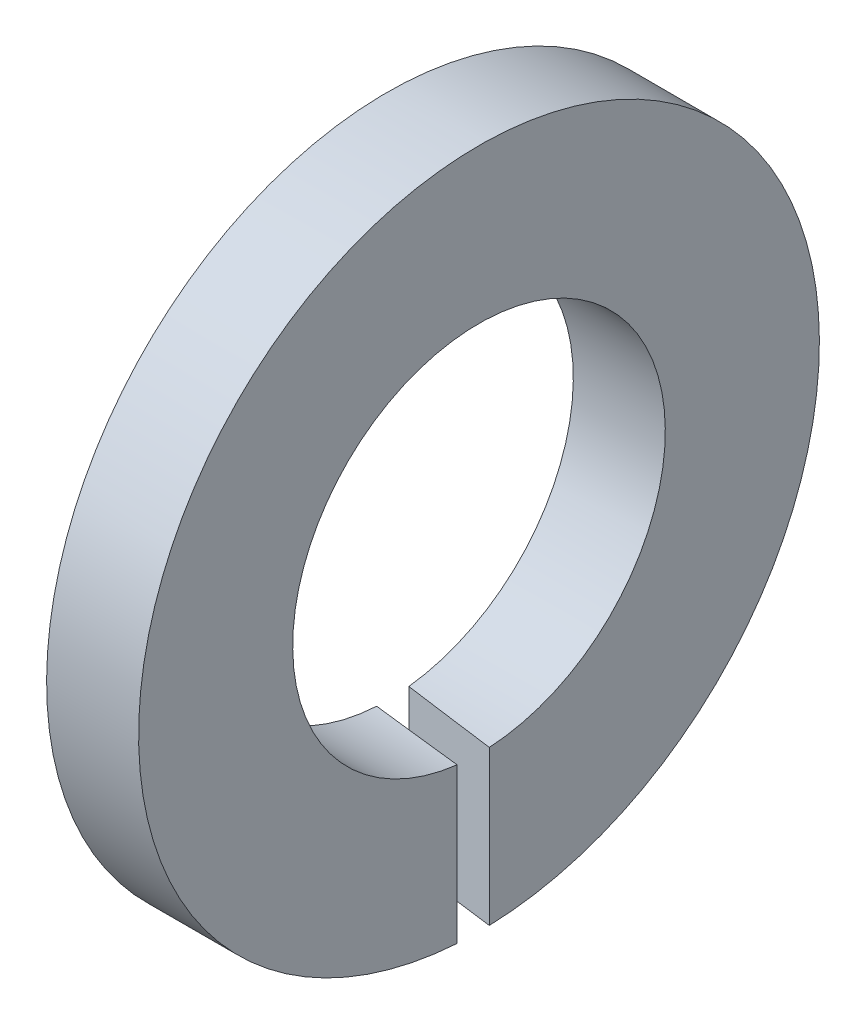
ISO-10303-21;
HEADER;
FILE_DESCRIPTION(('STEP AP214'),'2;1');
FILE_NAME('part.step','',(''),(''),'','','');
FILE_SCHEMA(('AUTOMOTIVE_DESIGN { 1 0 10303 214 1 1 1 1 }'));
ENDSEC;
DATA;
#1=APPLICATION_CONTEXT('core data for automotive mechanical design processes');
#2=APPLICATION_PROTOCOL_DEFINITION('international standard','automotive_design',2000,#1);
#3=PRODUCT_CONTEXT('',#1,'mechanical');
#4=PRODUCT('Part','Part','',(#3));
#5=PRODUCT_RELATED_PRODUCT_CATEGORY('part','',(#4));
#6=PRODUCT_DEFINITION_FORMATION('','',#4);
#7=PRODUCT_DEFINITION_CONTEXT('part definition',#1,'design');
#8=PRODUCT_DEFINITION('design','',#6,#7);
#9=PRODUCT_DEFINITION_SHAPE('','',#8);
#10=(LENGTH_UNIT() NAMED_UNIT(*) SI_UNIT(.MILLI.,.METRE.));
#11=(NAMED_UNIT(*) PLANE_ANGLE_UNIT() SI_UNIT($,.RADIAN.));
#12=(NAMED_UNIT(*) SI_UNIT($,.STERADIAN.) SOLID_ANGLE_UNIT());
#13=UNCERTAINTY_MEASURE_WITH_UNIT(LENGTH_MEASURE(1.E-05),#10,'distance_accuracy_value','');
#14=(GEOMETRIC_REPRESENTATION_CONTEXT(3) GLOBAL_UNCERTAINTY_ASSIGNED_CONTEXT((#13)) GLOBAL_UNIT_ASSIGNED_CONTEXT((#10,
#11,#12)) REPRESENTATION_CONTEXT('',''));
#15=CARTESIAN_POINT('',(0.,0.,0.));
#16=DIRECTION('',(0.,0.,1.));
#17=DIRECTION('',(1.,0.,0.));
#18=AXIS2_PLACEMENT_3D('',#15,#16,#17);
#19=CARTESIAN_POINT('',(2.,0.,-5.725));
#20=DIRECTION('',(1.,0.,0.));
#21=DIRECTION('',(0.,0.,-1.));
#22=AXIS2_PLACEMENT_3D('',#19,#20,#21);
#23=PLANE('',#22);
#24=CARTESIAN_POINT('',(2.,0.,0.));
#25=DIRECTION('',(1.,0.,0.));
#26=DIRECTION('',(0.,0.,-1.));
#27=AXIS2_PLACEMENT_3D('',#24,#25,#26);
#28=CIRCLE('',#27,4.05);
#29=CARTESIAN_POINT('',(2.00000000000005,-4.02204860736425,0.47499999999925));
#30=VERTEX_POINT('',#29);
#31=CARTESIAN_POINT('',(1.99999999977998,-4.04374517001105,-0.22500000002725));
#32=VERTEX_POINT('',#31);
#33=EDGE_CURVE('E66',#30,#32,#28,.F.);
#34=ORIENTED_EDGE('',*,*,#33,.T.);
#35=DIRECTION('',(0.,1.,0.));
#36=VECTOR('',#35,1.);
#37=CARTESIAN_POINT('',(1.99999999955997,0.,-0.225000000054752));
#38=LINE('',#37,#36);
#39=CARTESIAN_POINT('',(1.99999999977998,-7.39657860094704,-0.22500000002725));
#40=VERTEX_POINT('',#39);
#41=EDGE_CURVE('E61',#32,#40,#38,.F.);
#42=ORIENTED_EDGE('',*,*,#41,.T.);
#43=CARTESIAN_POINT('',(2.,0.,0.));
#44=DIRECTION('',(1.,0.,0.));
#45=DIRECTION('',(0.,0.,-1.));
#46=AXIS2_PLACEMENT_3D('',#43,#44,#45);
#47=CIRCLE('',#46,7.4);
#48=CARTESIAN_POINT('',(2.00000000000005,-7.38473933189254,0.47499999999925));
#49=VERTEX_POINT('',#48);
#50=EDGE_CURVE('E65',#49,#40,#47,.F.);
#51=ORIENTED_EDGE('',*,*,#50,.F.);
#52=DIRECTION('',(0.,1.,0.));
#53=VECTOR('',#52,1.);
#54=CARTESIAN_POINT('',(2.00000000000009,0.,0.474999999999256));
#55=LINE('',#54,#53);
#56=EDGE_CURVE('E76',#49,#30,#55,.T.);
#57=ORIENTED_EDGE('',*,*,#56,.T.);
#58=EDGE_LOOP('',(#34,#42,#51,#57));
#59=FACE_BOUND('',#58,.T.);
#60=ADVANCED_FACE('F16',(#59),#23,.T.);
#61=CARTESIAN_POINT('',(3.,0.,-0.1));
#62=DIRECTION('',(0.124034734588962,0.,-0.992277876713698));
#63=DIRECTION('',(-0.992277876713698,0.,-0.124034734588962));
#64=AXIS2_PLACEMENT_3D('',#61,#62,#63);
#65=PLANE('',#64);
#66=CARTESIAN_POINT('',(3.80000000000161,0.,0.));
#67=DIRECTION('',(0.124034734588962,0.,-0.992277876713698));
#68=DIRECTION('',(0.992277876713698,0.,0.124034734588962));
#69=AXIS2_PLACEMENT_3D('',#66,#67,#68);
#70=ELLIPSE('',#69,32.6521438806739,4.05);
#71=CARTESIAN_POINT('',(2.68497789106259E-10,-4.02204860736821,-0.47499999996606));
#72=VERTEX_POINT('',#71);
#73=EDGE_CURVE('E19',#32,#72,#70,.T.);
#74=ORIENTED_EDGE('',*,*,#73,.T.);
#75=DIRECTION('',(0.,1.,0.));
#76=VECTOR('',#75,1.);
#77=CARTESIAN_POINT('',(0.,0.,-0.475));
#78=LINE('',#77,#76);
#79=CARTESIAN_POINT('',(0.,-7.38473933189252,-0.474999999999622));
#80=VERTEX_POINT('',#79);
#81=EDGE_CURVE('E71',#80,#72,#78,.T.);
#82=ORIENTED_EDGE('',*,*,#81,.F.);
#83=CARTESIAN_POINT('',(3.80000000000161,0.,0.));
#84=DIRECTION('',(0.124034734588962,0.,-0.992277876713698));
#85=DIRECTION('',(0.992277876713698,0.,0.124034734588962));
#86=AXIS2_PLACEMENT_3D('',#83,#84,#85);
#87=ELLIPSE('',#86,59.6607073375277,7.4);
#88=EDGE_CURVE('E69',#40,#80,#87,.T.);
#89=ORIENTED_EDGE('',*,*,#88,.F.);
#90=ORIENTED_EDGE('',*,*,#41,.F.);
#91=EDGE_LOOP('',(#74,#82,#89,#90));
#92=FACE_BOUND('',#91,.T.);
#93=ADVANCED_FACE('F70',(#92),#65,.F.);
#94=CARTESIAN_POINT('',(1.,0.,0.));
#95=DIRECTION('',(1.,0.,0.));
#96=DIRECTION('',(0.,0.,-1.));
#97=AXIS2_PLACEMENT_3D('',#94,#95,#96);
#98=CYLINDRICAL_SURFACE('',#97,4.05);
#99=ORIENTED_EDGE('',*,*,#33,.F.);
#100=CARTESIAN_POINT('',(-1.80000000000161,0.,0.));
#101=DIRECTION('',(-0.124034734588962,0.,0.992277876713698));
#102=DIRECTION('',(0.992277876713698,0.,0.124034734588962));
#103=AXIS2_PLACEMENT_3D('',#100,#101,#102);
#104=ELLIPSE('',#103,32.6521438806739,4.05);
#105=CARTESIAN_POINT('',(0.,-4.04374517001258,0.224999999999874));
#106=VERTEX_POINT('',#105);
#107=EDGE_CURVE('E80',#30,#106,#104,.F.);
#108=ORIENTED_EDGE('',*,*,#107,.T.);
#109=CARTESIAN_POINT('',(5.36995361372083E-10,0.,0.));
#110=DIRECTION('',(1.,0.,0.));
#111=DIRECTION('',(0.,0.,-1.));
#112=AXIS2_PLACEMENT_3D('',#109,#110,#111);
#113=CIRCLE('',#112,4.05);
#114=EDGE_CURVE('E87',#72,#106,#113,.T.);
#115=ORIENTED_EDGE('',*,*,#114,.F.);
#116=ORIENTED_EDGE('',*,*,#73,.F.);
#117=EDGE_LOOP('',(#99,#108,#115,#116));
#118=FACE_BOUND('',#117,.T.);
#119=ADVANCED_FACE('F100',(#118),#98,.F.);
#120=CARTESIAN_POINT('',(-1.,0.,0.1));
#121=DIRECTION('',(-0.124034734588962,0.,0.992277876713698));
#122=DIRECTION('',(0.992277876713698,0.,0.124034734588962));
#123=AXIS2_PLACEMENT_3D('',#120,#121,#122);
#124=PLANE('',#123);
#125=CARTESIAN_POINT('',(-1.80000000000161,0.,0.));
#126=DIRECTION('',(-0.124034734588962,0.,0.992277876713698));
#127=DIRECTION('',(0.992277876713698,0.,0.124034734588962));
#128=AXIS2_PLACEMENT_3D('',#125,#126,#127);
#129=ELLIPSE('',#128,59.6607073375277,7.4);
#130=CARTESIAN_POINT('',(0.,-7.39657860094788,0.224999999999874));
#131=VERTEX_POINT('',#130);
#132=EDGE_CURVE('E34',#131,#49,#129,.T.);
#133=ORIENTED_EDGE('',*,*,#132,.F.);
#134=DIRECTION('',(0.,1.,0.));
#135=VECTOR('',#134,1.);
#136=CARTESIAN_POINT('',(0.,0.,0.225));
#137=LINE('',#136,#135);
#138=EDGE_CURVE('E25',#106,#131,#137,.F.);
#139=ORIENTED_EDGE('',*,*,#138,.F.);
#140=ORIENTED_EDGE('',*,*,#107,.F.);
#141=ORIENTED_EDGE('',*,*,#56,.F.);
#142=EDGE_LOOP('',(#133,#139,#140,#141));
#143=FACE_BOUND('',#142,.T.);
#144=ADVANCED_FACE('F95',(#143),#124,.F.);
#145=CARTESIAN_POINT('',(1.,0.,0.));
#146=DIRECTION('',(1.,0.,0.));
#147=DIRECTION('',(0.,0.,-1.));
#148=AXIS2_PLACEMENT_3D('',#145,#146,#147);
#149=CYLINDRICAL_SURFACE('',#148,7.4);
#150=ORIENTED_EDGE('',*,*,#88,.T.);
#151=CARTESIAN_POINT('',(0.,0.,0.));
#152=DIRECTION('',(1.,0.,0.));
#153=DIRECTION('',(0.,0.,-1.));
#154=AXIS2_PLACEMENT_3D('',#151,#152,#153);
#155=CIRCLE('',#154,7.4);
#156=EDGE_CURVE('E11',#131,#80,#155,.F.);
#157=ORIENTED_EDGE('',*,*,#156,.F.);
#158=ORIENTED_EDGE('',*,*,#132,.T.);
#159=ORIENTED_EDGE('',*,*,#50,.T.);
#160=EDGE_LOOP('',(#150,#157,#158,#159));
#161=FACE_BOUND('',#160,.T.);
#162=ADVANCED_FACE('F74',(#161),#149,.T.);
#163=CARTESIAN_POINT('',(0.,0.,-5.725));
#164=DIRECTION('',(-1.,0.,0.));
#165=DIRECTION('',(0.,0.,1.));
#166=AXIS2_PLACEMENT_3D('',#163,#164,#165);
#167=PLANE('',#166);
#168=ORIENTED_EDGE('',*,*,#156,.T.);
#169=ORIENTED_EDGE('',*,*,#81,.T.);
#170=ORIENTED_EDGE('',*,*,#114,.T.);
#171=ORIENTED_EDGE('',*,*,#138,.T.);
#172=EDGE_LOOP('',(#168,#169,#170,#171));
#173=FACE_BOUND('',#172,.T.);
#174=ADVANCED_FACE('F88',(#173),#167,.T.);
#175=CLOSED_SHELL('',(#60,#93,#119,#144,#162,#174));
#176=MANIFOLD_SOLID_BREP('B1',#175);
#177=ADVANCED_BREP_SHAPE_REPRESENTATION('',(#18,#176),#14);
#178=SHAPE_DEFINITION_REPRESENTATION(#9,#177);
ENDSEC;
END-ISO-10303-21;
